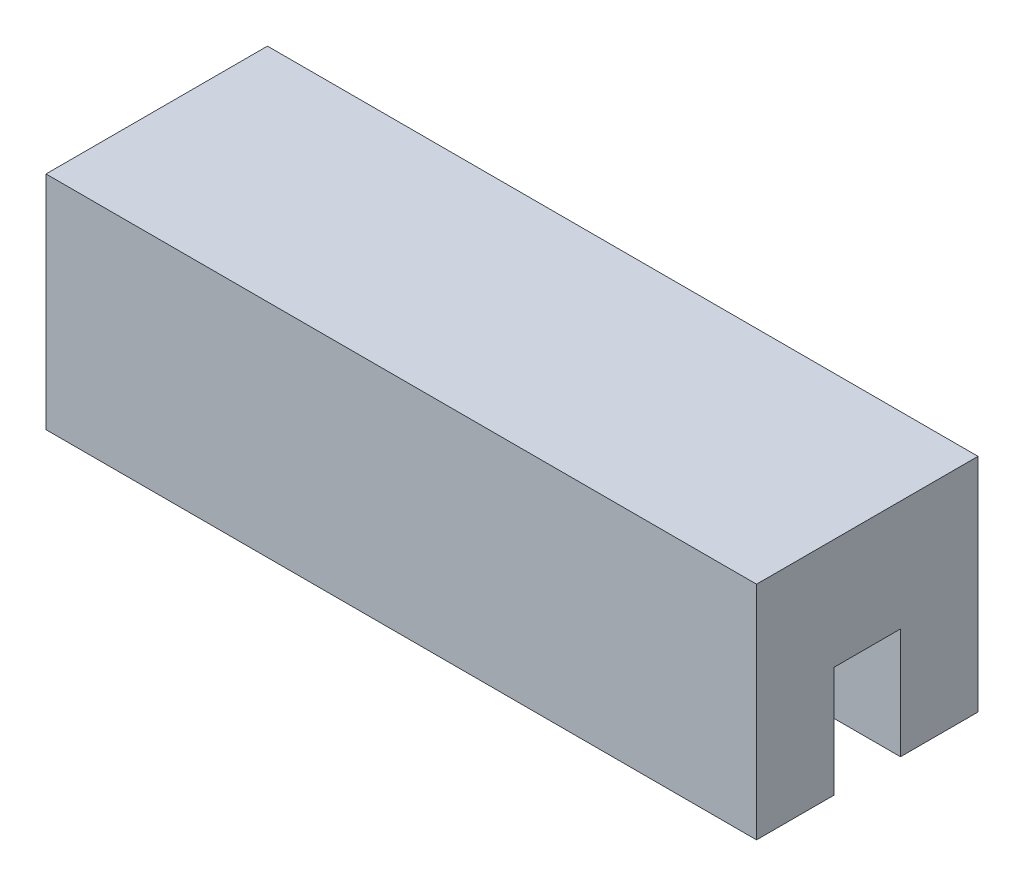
from build123d import *

# Parameters (mm, degrees)
SKETCH2_W           = 24
SKETCH2_H           = 24
BOSS_EXTRUDE1_DEPTH = 77
SKETCH3_W           = 3.6
SKETCH3_H           = 12
CUT_EXTRUDE3_DEPTH  = 77
SKETCH4_R           = 2.1
SKETCH4_R_2         = 4.5
CUT_EXTRUDE4_DEPTH  = 8.4


with BuildPart() as part:
    # Sketch2 → Boss-Extrude1 (new body)
    with BuildSketch(Plane(origin=(0, 0, 0), x_dir=(0, 0, -1), z_dir=(1, 0, 0))):
        Rectangle(SKETCH2_W, SKETCH2_H)
    extrude(amount=BOSS_EXTRUDE1_DEPTH)

    # Sketch3 → Cut-Extrude3 (cut)
    with BuildSketch(Plane(origin=(77, 0, 0), x_dir=(0, 0, -1), z_dir=(1, 0, 0))):
        with Locations((1.8, -6)):
            Rectangle(SKETCH3_W, SKETCH3_H)
    cut_extrude3 = extrude(amount=-CUT_EXTRUDE3_DEPTH, mode=Mode.SUBTRACT)

    # Mirror1: Cut-Extrude3 across plane
    add(cut_extrude3.mirror(Plane.XY), mode=Mode.SUBTRACT)

    # Sketch4 → Cut-Extrude4 (cut)
    with BuildSketch(Plane.XY.offset(-12)):
        with Locations(Location((40, 2, 0), (0, 0, 252.247209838))):
            Circle(SKETCH4_R)
        with Locations(Location((22.5, -6, 0), (0, 0, 90))):
            Circle(SKETCH4_R_2)
        with Locations(Location((5, 2, 0), (0, 0, 252.247209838))):
            Circle(SKETCH4_R)
    extrude(amount=CUT_EXTRUDE4_DEPTH, mode=Mode.SUBTRACT)


solid = part.part
